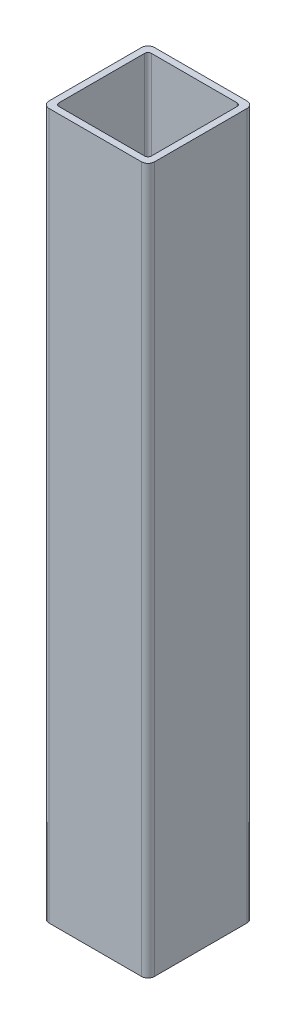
from build123d import *

# Parameters (mm, degrees)
BOSS_EXTRUDE1_DEPTH = 169.8625


with BuildPart() as part:
    # Sketch1 → Boss-Extrude1 (new, symmetric)
    with BuildSketch(Plane(origin=(0, 0, 0), x_dir=(0, 0, -1), z_dir=(0, 1, 0))):
        with BuildLine():
            Line((-22.225, 25.4), (22.225, 25.4))
            ThreePointArc((22.225, 25.4), (24.47006403, 24.47006403), (25.4, 22.225))
            Line((25.4, 22.225), (25.4, -22.225))
            ThreePointArc((25.4, -22.225), (24.47006403, -24.47006403), (22.225, -25.4))
            Line((22.225, -25.4), (-22.225, -25.4))
            ThreePointArc((-22.225, -25.4), (-24.47006403, -24.47006403), (-25.4, -22.225))
            Line((-25.4, -22.225), (-25.4, 22.225))
            ThreePointArc((-25.4, 22.225), (-24.47006403, 24.47006403), (-22.225, 25.4))
        make_face()
        with BuildLine():
            Line((-20.6375, 22.225), (20.6375, 22.225))
            ThreePointArc((20.6375, 22.225), (21.760032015, 21.760032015), (22.225, 20.6375))
            Line((22.225, 20.6375), (22.225, -20.6375))
            ThreePointArc((22.225, -20.6375), (21.760032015, -21.760032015), (20.6375, -22.225))
            Line((20.6375, -22.225), (-20.6375, -22.225))
            ThreePointArc((-20.6375, -22.225), (-21.760032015, -21.760032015), (-22.225, -20.6375))
            Line((-22.225, -20.6375), (-22.225, 20.6375))
            ThreePointArc((-22.225, 20.6375), (-21.760032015, 21.760032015), (-20.6375, 22.225))
        make_face(mode=Mode.SUBTRACT)
    extrude(amount=BOSS_EXTRUDE1_DEPTH, both=True)


solid = part.part
